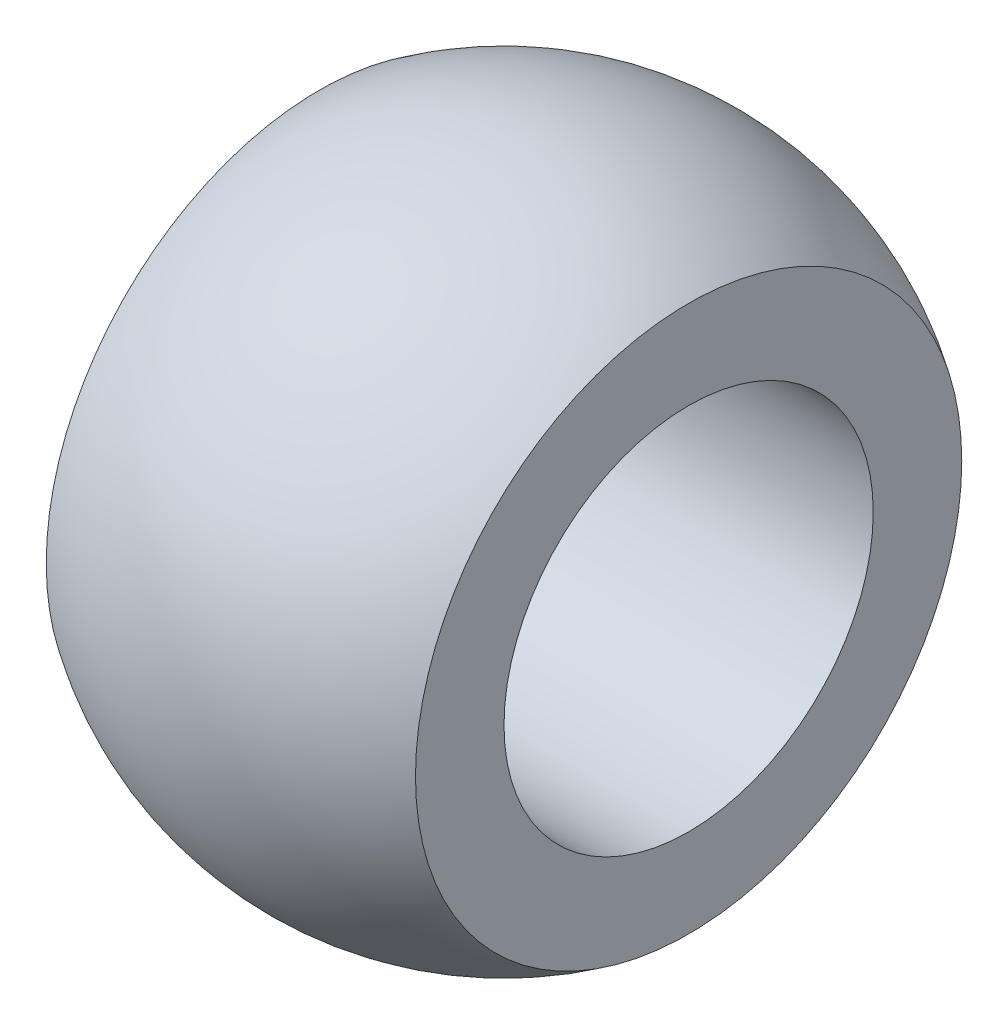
ISO-10303-21;
HEADER;
FILE_DESCRIPTION(('STEP AP214'),'2;1');
FILE_NAME('part.step','',(''),(''),'','','');
FILE_SCHEMA(('AUTOMOTIVE_DESIGN { 1 0 10303 214 1 1 1 1 }'));
ENDSEC;
DATA;
#1=APPLICATION_CONTEXT('core data for automotive mechanical design processes');
#2=APPLICATION_PROTOCOL_DEFINITION('international standard','automotive_design',2000,#1);
#3=PRODUCT_CONTEXT('',#1,'mechanical');
#4=PRODUCT('Part','Part','',(#3));
#5=PRODUCT_RELATED_PRODUCT_CATEGORY('part','',(#4));
#6=PRODUCT_DEFINITION_FORMATION('','',#4);
#7=PRODUCT_DEFINITION_CONTEXT('part definition',#1,'design');
#8=PRODUCT_DEFINITION('design','',#6,#7);
#9=PRODUCT_DEFINITION_SHAPE('','',#8);
#10=(LENGTH_UNIT() NAMED_UNIT(*) SI_UNIT(.MILLI.,.METRE.));
#11=(NAMED_UNIT(*) PLANE_ANGLE_UNIT() SI_UNIT($,.RADIAN.));
#12=(NAMED_UNIT(*) SI_UNIT($,.STERADIAN.) SOLID_ANGLE_UNIT());
#13=UNCERTAINTY_MEASURE_WITH_UNIT(LENGTH_MEASURE(1.E-05),#10,'distance_accuracy_value','');
#14=(GEOMETRIC_REPRESENTATION_CONTEXT(3) GLOBAL_UNCERTAINTY_ASSIGNED_CONTEXT((#13)) GLOBAL_UNIT_ASSIGNED_CONTEXT((#10,
#11,#12)) REPRESENTATION_CONTEXT('',''));
#15=CARTESIAN_POINT('',(0.,0.,0.));
#16=DIRECTION('',(0.,0.,1.));
#17=DIRECTION('',(1.,0.,0.));
#18=AXIS2_PLACEMENT_3D('',#15,#16,#17);
#19=CARTESIAN_POINT('',(0.,0.,0.));
#20=DIRECTION('',(0.,0.,1.));
#21=DIRECTION('',(1.,0.,0.));
#22=AXIS2_PLACEMENT_3D('',#19,#20,#21);
#23=SPHERICAL_SURFACE('',#22,12.5);
#24=CARTESIAN_POINT('',(0.,0.,0.));
#25=DIRECTION('',(-1.,0.,0.));
#26=DIRECTION('',(0.,0.,1.));
#27=AXIS2_PLACEMENT_3D('',#24,#25,#26);
#28=SPHERICAL_SURFACE('',#27,12.5);
#29=CARTESIAN_POINT('',(-7.,0.,0.));
#30=DIRECTION('',(-1.,0.,0.));
#31=DIRECTION('',(0.,0.,1.));
#32=AXIS2_PLACEMENT_3D('',#29,#30,#31);
#33=CIRCLE('',#32,10.356157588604);
#34=CARTESIAN_POINT('',(-7.,0.,10.356157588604));
#35=VERTEX_POINT('',#34);
#36=EDGE_CURVE('E10',#35,#35,#33,.T.);
#37=ORIENTED_EDGE('',*,*,#36,.F.);
#38=EDGE_LOOP('',(#37));
#39=FACE_BOUND('',#38,.T.);
#40=CARTESIAN_POINT('',(7.,0.,0.));
#41=DIRECTION('',(-1.,0.,0.));
#42=DIRECTION('',(0.,0.,1.));
#43=AXIS2_PLACEMENT_3D('',#40,#41,#42);
#44=CIRCLE('',#43,10.356157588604);
#45=CARTESIAN_POINT('',(7.,0.,10.356157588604));
#46=VERTEX_POINT('',#45);
#47=EDGE_CURVE('E47',#46,#46,#44,.T.);
#48=ORIENTED_EDGE('',*,*,#47,.T.);
#49=EDGE_LOOP('',(#48));
#50=FACE_BOUND('',#49,.T.);
#51=ADVANCED_FACE('F32',(#39,#50),#28,.T.);
#52=CARTESIAN_POINT('',(-7.,10.356157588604,0.));
#53=DIRECTION('',(1.,0.,0.));
#54=DIRECTION('',(0.,0.,-1.));
#55=AXIS2_PLACEMENT_3D('',#52,#53,#54);
#56=PLANE('',#55);
#57=CARTESIAN_POINT('',(-7.,0.,0.));
#58=DIRECTION('',(-1.,0.,0.));
#59=DIRECTION('',(0.,0.,1.));
#60=AXIS2_PLACEMENT_3D('',#57,#58,#59);
#61=CIRCLE('',#60,7.);
#62=CARTESIAN_POINT('',(-7.,0.,7.));
#63=VERTEX_POINT('',#62);
#64=EDGE_CURVE('E38',#63,#63,#61,.T.);
#65=ORIENTED_EDGE('',*,*,#64,.F.);
#66=EDGE_LOOP('',(#65));
#67=FACE_BOUND('',#66,.T.);
#68=ORIENTED_EDGE('',*,*,#36,.T.);
#69=EDGE_LOOP('',(#68));
#70=FACE_BOUND('',#69,.T.);
#71=ADVANCED_FACE('F65',(#67,#70),#56,.F.);
#72=CARTESIAN_POINT('',(-20.,0.,0.));
#73=DIRECTION('',(-1.,0.,0.));
#74=DIRECTION('',(0.,0.,1.));
#75=AXIS2_PLACEMENT_3D('',#72,#73,#74);
#76=CYLINDRICAL_SURFACE('',#75,7.);
#77=CARTESIAN_POINT('',(7.,0.,0.));
#78=DIRECTION('',(-1.,0.,0.));
#79=DIRECTION('',(0.,0.,1.));
#80=AXIS2_PLACEMENT_3D('',#77,#78,#79);
#81=CIRCLE('',#80,7.);
#82=CARTESIAN_POINT('',(7.,0.,7.));
#83=VERTEX_POINT('',#82);
#84=EDGE_CURVE('E42',#83,#83,#81,.T.);
#85=ORIENTED_EDGE('',*,*,#84,.F.);
#86=EDGE_LOOP('',(#85));
#87=FACE_BOUND('',#86,.T.);
#88=ORIENTED_EDGE('',*,*,#64,.T.);
#89=EDGE_LOOP('',(#88));
#90=FACE_BOUND('',#89,.T.);
#91=ADVANCED_FACE('F59',(#87,#90),#76,.F.);
#92=CARTESIAN_POINT('',(7.,10.356157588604,0.));
#93=DIRECTION('',(1.,0.,0.));
#94=DIRECTION('',(0.,0.,-1.));
#95=AXIS2_PLACEMENT_3D('',#92,#93,#94);
#96=PLANE('',#95);
#97=ORIENTED_EDGE('',*,*,#84,.T.);
#98=EDGE_LOOP('',(#97));
#99=FACE_BOUND('',#98,.T.);
#100=ORIENTED_EDGE('',*,*,#47,.F.);
#101=EDGE_LOOP('',(#100));
#102=FACE_BOUND('',#101,.T.);
#103=ADVANCED_FACE('F57',(#99,#102),#96,.T.);
#104=CLOSED_SHELL('',(#51,#71,#91,#103));
#105=MANIFOLD_SOLID_BREP('B2',#104);
#106=ADVANCED_BREP_SHAPE_REPRESENTATION('',(#18,#105),#14);
#107=SHAPE_DEFINITION_REPRESENTATION(#9,#106);
ENDSEC;
END-ISO-10303-21;
